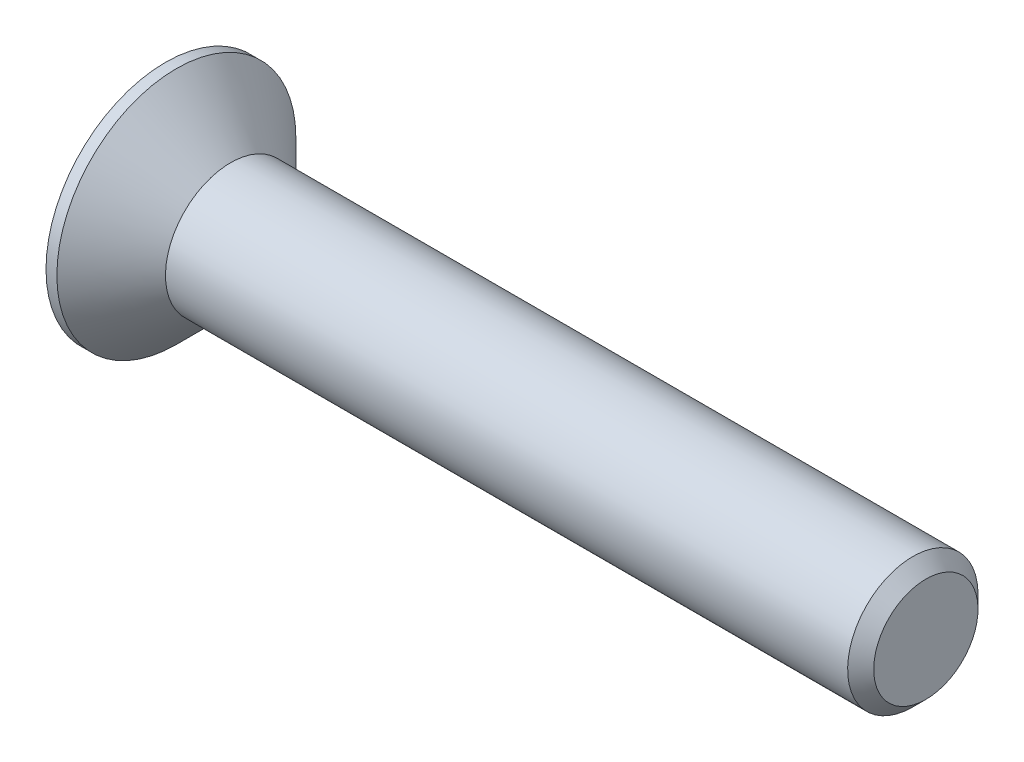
from build123d import *

# Parameters (mm, degrees)
CHAMFER1_SIZE      = 0.6
CUT_EXTRUDE1_DEPTH = 2.5


with BuildPart() as part:
    # Sketch1 → Revolve1 (revolve)
    with BuildSketch(Plane.XY, mode=Mode.PRIVATE) as revolve1_sk:
        Polygon((-3, 5.5), (-3, 0), (32, 0), (32, 3), (0, 3), (-2.5, 5.5), align=None)
    revolve(revolve1_sk.sketch.rotate(Axis((-3, 0, 0), (1, 0, 0)), 180), axis=Axis((-3, 0, 0), (1, 0, 0)))

    # Chamfer1
    chamfer1_edges = [part.edges().sort_by_distance(p)[0] for p in [
        (32, 3, 0),
    ]]
    chamfer(chamfer1_edges, length=CHAMFER1_SIZE)

    # Sketch2 → Cut-Extrude1 (cut)
    with BuildSketch(Plane.ZY.offset(3)):
        Polygon((-0.825, 3.3), (0.825, 3.3), (0.825, 0.825), (3.3, 0.825), (3.3, -0.825), (0.825, -0.825), (0.825, -3.3), (-0.825, -3.3), (-0.825, -0.825), (-3.3, -0.825), (-3.3, 0.825), (-0.825, 0.825), align=None)
    extrude(amount=-CUT_EXTRUDE1_DEPTH, mode=Mode.SUBTRACT)


solid = part.part
